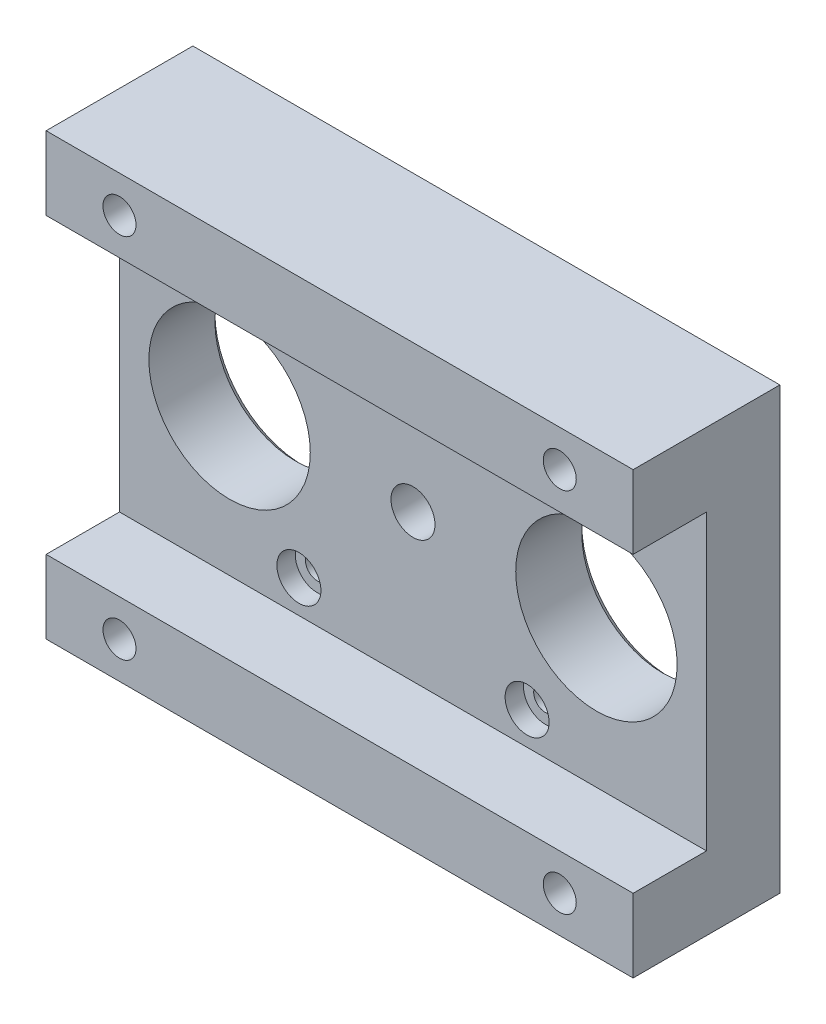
ISO-10303-21;
HEADER;
FILE_DESCRIPTION(('STEP AP214'),'2;1');
FILE_NAME('part.step','',(''),(''),'','','');
FILE_SCHEMA(('AUTOMOTIVE_DESIGN { 1 0 10303 214 1 1 1 1 }'));
ENDSEC;
DATA;
#1=APPLICATION_CONTEXT('core data for automotive mechanical design processes');
#2=APPLICATION_PROTOCOL_DEFINITION('international standard','automotive_design',2000,#1);
#3=PRODUCT_CONTEXT('',#1,'mechanical');
#4=PRODUCT('Part','Part','',(#3));
#5=PRODUCT_RELATED_PRODUCT_CATEGORY('part','',(#4));
#6=PRODUCT_DEFINITION_FORMATION('','',#4);
#7=PRODUCT_DEFINITION_CONTEXT('part definition',#1,'design');
#8=PRODUCT_DEFINITION('design','',#6,#7);
#9=PRODUCT_DEFINITION_SHAPE('','',#8);
#10=(LENGTH_UNIT() NAMED_UNIT(*) SI_UNIT(.MILLI.,.METRE.));
#11=(NAMED_UNIT(*) PLANE_ANGLE_UNIT() SI_UNIT($,.RADIAN.));
#12=(NAMED_UNIT(*) SI_UNIT($,.STERADIAN.) SOLID_ANGLE_UNIT());
#13=UNCERTAINTY_MEASURE_WITH_UNIT(LENGTH_MEASURE(1.E-05),#10,'distance_accuracy_value','');
#14=(GEOMETRIC_REPRESENTATION_CONTEXT(3) GLOBAL_UNCERTAINTY_ASSIGNED_CONTEXT((#13)) GLOBAL_UNIT_ASSIGNED_CONTEXT((#10,
#11,#12)) REPRESENTATION_CONTEXT('',''));
#15=CARTESIAN_POINT('',(0.,0.,0.));
#16=DIRECTION('',(0.,0.,1.));
#17=DIRECTION('',(1.,0.,0.));
#18=AXIS2_PLACEMENT_3D('',#15,#16,#17);
#19=CARTESIAN_POINT('',(-15.55,15.55,-2.2));
#20=DIRECTION('',(0.,0.,1.));
#21=DIRECTION('',(1.,0.,0.));
#22=AXIS2_PLACEMENT_3D('',#19,#20,#21);
#23=CYLINDRICAL_SURFACE('',#22,1.6);
#24=CARTESIAN_POINT('',(-15.55,15.55,0.));
#25=DIRECTION('',(0.,0.,1.));
#26=DIRECTION('',(1.,0.,0.));
#27=AXIS2_PLACEMENT_3D('',#24,#25,#26);
#28=CIRCLE('',#27,1.6);
#29=CARTESIAN_POINT('',(-13.95,15.55,0.));
#30=VERTEX_POINT('',#29);
#31=EDGE_CURVE('E206',#30,#30,#28,.T.);
#32=ORIENTED_EDGE('',*,*,#31,.F.);
#33=EDGE_LOOP('',(#32));
#34=FACE_BOUND('',#33,.T.);
#35=CARTESIAN_POINT('',(-15.55,15.55,7.5));
#36=DIRECTION('',(0.,0.,1.));
#37=DIRECTION('',(1.,0.,0.));
#38=AXIS2_PLACEMENT_3D('',#35,#36,#37);
#39=CIRCLE('',#38,1.6);
#40=CARTESIAN_POINT('',(-13.95,15.55,7.5));
#41=VERTEX_POINT('',#40);
#42=EDGE_CURVE('E211',#41,#41,#39,.F.);
#43=ORIENTED_EDGE('',*,*,#42,.F.);
#44=EDGE_LOOP('',(#43));
#45=FACE_BOUND('',#44,.T.);
#46=ADVANCED_FACE('F44',(#34,#45),#23,.F.);
#47=CARTESIAN_POINT('',(15.55,15.55,-2.2));
#48=DIRECTION('',(0.,0.,1.));
#49=DIRECTION('',(1.,0.,0.));
#50=AXIS2_PLACEMENT_3D('',#47,#48,#49);
#51=CYLINDRICAL_SURFACE('',#50,1.6);
#52=CARTESIAN_POINT('',(15.55,15.55,0.));
#53=DIRECTION('',(0.,0.,1.));
#54=DIRECTION('',(1.,0.,0.));
#55=AXIS2_PLACEMENT_3D('',#52,#53,#54);
#56=CIRCLE('',#55,1.6);
#57=CARTESIAN_POINT('',(17.15,15.55,0.));
#58=VERTEX_POINT('',#57);
#59=EDGE_CURVE('E210',#58,#58,#56,.T.);
#60=ORIENTED_EDGE('',*,*,#59,.F.);
#61=EDGE_LOOP('',(#60));
#62=FACE_BOUND('',#61,.T.);
#63=CARTESIAN_POINT('',(15.55,15.55,7.5));
#64=DIRECTION('',(0.,0.,1.));
#65=DIRECTION('',(1.,0.,0.));
#66=AXIS2_PLACEMENT_3D('',#63,#64,#65);
#67=CIRCLE('',#66,1.6);
#68=CARTESIAN_POINT('',(17.15,15.55,7.5));
#69=VERTEX_POINT('',#68);
#70=EDGE_CURVE('E233',#69,#69,#67,.F.);
#71=ORIENTED_EDGE('',*,*,#70,.F.);
#72=EDGE_LOOP('',(#71));
#73=FACE_BOUND('',#72,.T.);
#74=ADVANCED_FACE('F420',(#62,#73),#51,.F.);
#75=CARTESIAN_POINT('',(15.55,-15.55,-2.2));
#76=DIRECTION('',(0.,0.,1.));
#77=DIRECTION('',(1.,0.,0.));
#78=AXIS2_PLACEMENT_3D('',#75,#76,#77);
#79=CYLINDRICAL_SURFACE('',#78,1.6);
#80=CARTESIAN_POINT('',(15.55,-15.55,0.));
#81=DIRECTION('',(0.,0.,1.));
#82=DIRECTION('',(1.,0.,0.));
#83=AXIS2_PLACEMENT_3D('',#80,#81,#82);
#84=CIRCLE('',#83,1.6);
#85=CARTESIAN_POINT('',(17.15,-15.55,0.));
#86=VERTEX_POINT('',#85);
#87=EDGE_CURVE('E215',#86,#86,#84,.T.);
#88=ORIENTED_EDGE('',*,*,#87,.F.);
#89=EDGE_LOOP('',(#88));
#90=FACE_BOUND('',#89,.T.);
#91=CARTESIAN_POINT('',(15.55,-15.55,7.5));
#92=DIRECTION('',(0.,0.,1.));
#93=DIRECTION('',(1.,0.,0.));
#94=AXIS2_PLACEMENT_3D('',#91,#92,#93);
#95=CIRCLE('',#94,1.6);
#96=CARTESIAN_POINT('',(17.15,-15.55,7.5));
#97=VERTEX_POINT('',#96);
#98=EDGE_CURVE('E228',#97,#97,#95,.F.);
#99=ORIENTED_EDGE('',*,*,#98,.F.);
#100=EDGE_LOOP('',(#99));
#101=FACE_BOUND('',#100,.T.);
#102=ADVANCED_FACE('F426',(#90,#101),#79,.F.);
#103=CARTESIAN_POINT('',(-15.55,-15.55,-2.2));
#104=DIRECTION('',(0.,0.,1.));
#105=DIRECTION('',(1.,0.,0.));
#106=AXIS2_PLACEMENT_3D('',#103,#104,#105);
#107=CYLINDRICAL_SURFACE('',#106,1.6);
#108=CARTESIAN_POINT('',(-15.55,-15.55,0.));
#109=DIRECTION('',(0.,0.,1.));
#110=DIRECTION('',(1.,0.,0.));
#111=AXIS2_PLACEMENT_3D('',#108,#109,#110);
#112=CIRCLE('',#111,1.6);
#113=CARTESIAN_POINT('',(-13.95,-15.55,0.));
#114=VERTEX_POINT('',#113);
#115=EDGE_CURVE('E219',#114,#114,#112,.T.);
#116=ORIENTED_EDGE('',*,*,#115,.F.);
#117=EDGE_LOOP('',(#116));
#118=FACE_BOUND('',#117,.T.);
#119=CARTESIAN_POINT('',(-15.55,-15.55,7.5));
#120=DIRECTION('',(0.,0.,1.));
#121=DIRECTION('',(1.,0.,0.));
#122=AXIS2_PLACEMENT_3D('',#119,#120,#121);
#123=CIRCLE('',#122,1.6);
#124=CARTESIAN_POINT('',(-13.95,-15.55,7.5));
#125=VERTEX_POINT('',#124);
#126=EDGE_CURVE('E224',#125,#125,#123,.F.);
#127=ORIENTED_EDGE('',*,*,#126,.F.);
#128=EDGE_LOOP('',(#127));
#129=FACE_BOUND('',#128,.T.);
#130=ADVANCED_FACE('F385',(#118,#129),#107,.F.);
#131=CARTESIAN_POINT('',(0.,0.,10.));
#132=DIRECTION('',(0.,0.,1.));
#133=DIRECTION('',(1.,0.,0.));
#134=AXIS2_PLACEMENT_3D('',#131,#132,#133);
#135=PLANE('',#134);
#136=CARTESIAN_POINT('',(15.55,15.55,10.));
#137=DIRECTION('',(0.,0.,1.));
#138=DIRECTION('',(1.,0.,0.));
#139=AXIS2_PLACEMENT_3D('',#136,#137,#138);
#140=CIRCLE('',#139,3.);
#141=CARTESIAN_POINT('',(18.55,15.55,10.));
#142=VERTEX_POINT('',#141);
#143=EDGE_CURVE('E352',#142,#142,#140,.T.);
#144=ORIENTED_EDGE('',*,*,#143,.F.);
#145=EDGE_LOOP('',(#144));
#146=FACE_BOUND('',#145,.T.);
#147=CARTESIAN_POINT('',(-15.55,-15.55,10.));
#148=DIRECTION('',(0.,0.,1.));
#149=DIRECTION('',(1.,0.,0.));
#150=AXIS2_PLACEMENT_3D('',#147,#148,#149);
#151=CIRCLE('',#150,3.);
#152=CARTESIAN_POINT('',(-12.55,-15.55,10.));
#153=VERTEX_POINT('',#152);
#154=EDGE_CURVE('E360',#153,#153,#151,.T.);
#155=ORIENTED_EDGE('',*,*,#154,.F.);
#156=EDGE_LOOP('',(#155));
#157=FACE_BOUND('',#156,.T.);
#158=CARTESIAN_POINT('',(15.55,-15.55,10.));
#159=DIRECTION('',(0.,0.,1.));
#160=DIRECTION('',(1.,0.,0.));
#161=AXIS2_PLACEMENT_3D('',#158,#159,#160);
#162=CIRCLE('',#161,3.);
#163=CARTESIAN_POINT('',(18.55,-15.55,10.));
#164=VERTEX_POINT('',#163);
#165=EDGE_CURVE('E361',#164,#164,#162,.T.);
#166=ORIENTED_EDGE('',*,*,#165,.F.);
#167=EDGE_LOOP('',(#166));
#168=FACE_BOUND('',#167,.T.);
#169=CARTESIAN_POINT('',(-15.55,15.55,10.));
#170=DIRECTION('',(0.,0.,1.));
#171=DIRECTION('',(1.,0.,0.));
#172=AXIS2_PLACEMENT_3D('',#169,#170,#171);
#173=CIRCLE('',#172,3.);
#174=CARTESIAN_POINT('',(-12.55,15.55,10.));
#175=VERTEX_POINT('',#174);
#176=EDGE_CURVE('E348',#175,#175,#173,.T.);
#177=ORIENTED_EDGE('',*,*,#176,.F.);
#178=EDGE_LOOP('',(#177));
#179=FACE_BOUND('',#178,.T.);
#180=CARTESIAN_POINT('',(-25.,0.,10.));
#181=DIRECTION('',(0.,0.,1.));
#182=DIRECTION('',(1.,0.,0.));
#183=AXIS2_PLACEMENT_3D('',#180,#181,#182);
#184=CIRCLE('',#183,11.);
#185=CARTESIAN_POINT('',(-14.,0.,10.));
#186=VERTEX_POINT('',#185);
#187=EDGE_CURVE('E323',#186,#186,#184,.T.);
#188=ORIENTED_EDGE('',*,*,#187,.F.);
#189=EDGE_LOOP('',(#188));
#190=FACE_BOUND('',#189,.T.);
#191=CARTESIAN_POINT('',(25.,0.,10.));
#192=DIRECTION('',(0.,0.,1.));
#193=DIRECTION('',(1.,0.,0.));
#194=AXIS2_PLACEMENT_3D('',#191,#192,#193);
#195=CIRCLE('',#194,11.);
#196=CARTESIAN_POINT('',(36.,0.,10.));
#197=VERTEX_POINT('',#196);
#198=EDGE_CURVE('E223',#197,#197,#195,.T.);
#199=ORIENTED_EDGE('',*,*,#198,.F.);
#200=EDGE_LOOP('',(#199));
#201=FACE_BOUND('',#200,.T.);
#202=CARTESIAN_POINT('',(0.,0.,10.));
#203=DIRECTION('',(0.,0.,1.));
#204=DIRECTION('',(1.,0.,0.));
#205=AXIS2_PLACEMENT_3D('',#202,#203,#204);
#206=CIRCLE('',#205,3.);
#207=CARTESIAN_POINT('',(-3.,0.,10.));
#208=VERTEX_POINT('',#207);
#209=EDGE_CURVE('E200',#208,#208,#206,.T.);
#210=ORIENTED_EDGE('',*,*,#209,.F.);
#211=EDGE_LOOP('',(#210));
#212=FACE_BOUND('',#211,.T.);
#213=DIRECTION('',(0.,-1.,0.));
#214=VECTOR('',#213,1.);
#215=CARTESIAN_POINT('',(-40.,30.,10.));
#216=LINE('',#215,#214);
#217=CARTESIAN_POINT('',(-40.,20.,10.));
#218=VERTEX_POINT('',#217);
#219=CARTESIAN_POINT('',(-40.,-20.,10.));
#220=VERTEX_POINT('',#219);
#221=EDGE_CURVE('E66',#218,#220,#216,.T.);
#222=ORIENTED_EDGE('',*,*,#221,.T.);
#223=DIRECTION('',(-1.,0.,0.));
#224=VECTOR('',#223,1.);
#225=CARTESIAN_POINT('',(40.,-20.,10.));
#226=LINE('',#225,#224);
#227=CARTESIAN_POINT('',(40.,-20.,10.));
#228=VERTEX_POINT('',#227);
#229=EDGE_CURVE('E61',#228,#220,#226,.T.);
#230=ORIENTED_EDGE('',*,*,#229,.F.);
#231=DIRECTION('',(0.,1.,0.));
#232=VECTOR('',#231,1.);
#233=CARTESIAN_POINT('',(40.,30.,10.));
#234=LINE('',#233,#232);
#235=CARTESIAN_POINT('',(40.,20.,10.));
#236=VERTEX_POINT('',#235);
#237=EDGE_CURVE('E174',#228,#236,#234,.T.);
#238=ORIENTED_EDGE('',*,*,#237,.T.);
#239=DIRECTION('',(1.,0.,0.));
#240=VECTOR('',#239,1.);
#241=CARTESIAN_POINT('',(-40.,20.,10.));
#242=LINE('',#241,#240);
#243=EDGE_CURVE('E142',#218,#236,#242,.T.);
#244=ORIENTED_EDGE('',*,*,#243,.F.);
#245=EDGE_LOOP('',(#222,#230,#238,#244));
#246=FACE_BOUND('',#245,.T.);
#247=ADVANCED_FACE('F382',(#146,#157,#168,#179,#190,#201,#212,#246),#135,.T.);
#248=CARTESIAN_POINT('',(40.,30.,10.));
#249=DIRECTION('',(-1.,0.,0.));
#250=DIRECTION('',(0.,-1.,0.));
#251=AXIS2_PLACEMENT_3D('',#248,#249,#250);
#252=PLANE('',#251);
#253=DIRECTION('',(0.,1.,0.));
#254=VECTOR('',#253,1.);
#255=CARTESIAN_POINT('',(40.,30.,0.));
#256=LINE('',#255,#254);
#257=CARTESIAN_POINT('',(40.,-30.,0.));
#258=VERTEX_POINT('',#257);
#259=CARTESIAN_POINT('',(40.,30.,0.));
#260=VERTEX_POINT('',#259);
#261=EDGE_CURVE('E173',#258,#260,#256,.T.);
#262=ORIENTED_EDGE('',*,*,#261,.T.);
#263=DIRECTION('',(0.,0.,-1.));
#264=VECTOR('',#263,1.);
#265=CARTESIAN_POINT('',(40.,30.,10.));
#266=LINE('',#265,#264);
#267=CARTESIAN_POINT('',(40.,30.,20.));
#268=VERTEX_POINT('',#267);
#269=EDGE_CURVE('E195',#268,#260,#266,.T.);
#270=ORIENTED_EDGE('',*,*,#269,.F.);
#271=DIRECTION('',(0.,1.,0.));
#272=VECTOR('',#271,1.);
#273=CARTESIAN_POINT('',(40.,30.,20.));
#274=LINE('',#273,#272);
#275=CARTESIAN_POINT('',(40.,20.,20.));
#276=VERTEX_POINT('',#275);
#277=EDGE_CURVE('E154',#276,#268,#274,.T.);
#278=ORIENTED_EDGE('',*,*,#277,.F.);
#279=DIRECTION('',(0.,0.,-1.));
#280=VECTOR('',#279,1.);
#281=CARTESIAN_POINT('',(40.,20.,20.));
#282=LINE('',#281,#280);
#283=EDGE_CURVE('E162',#276,#236,#282,.T.);
#284=ORIENTED_EDGE('',*,*,#283,.T.);
#285=ORIENTED_EDGE('',*,*,#237,.F.);
#286=DIRECTION('',(0.,0.,-1.));
#287=VECTOR('',#286,1.);
#288=CARTESIAN_POINT('',(40.,-20.,20.));
#289=LINE('',#288,#287);
#290=CARTESIAN_POINT('',(40.,-20.,20.));
#291=VERTEX_POINT('',#290);
#292=EDGE_CURVE('E136',#291,#228,#289,.T.);
#293=ORIENTED_EDGE('',*,*,#292,.F.);
#294=DIRECTION('',(0.,1.,0.));
#295=VECTOR('',#294,1.);
#296=CARTESIAN_POINT('',(40.,-30.,20.));
#297=LINE('',#296,#295);
#298=CARTESIAN_POINT('',(40.,-30.,20.));
#299=VERTEX_POINT('',#298);
#300=EDGE_CURVE('E127',#299,#291,#297,.T.);
#301=ORIENTED_EDGE('',*,*,#300,.F.);
#302=DIRECTION('',(0.,0.,-1.));
#303=VECTOR('',#302,1.);
#304=CARTESIAN_POINT('',(40.,-30.,10.));
#305=LINE('',#304,#303);
#306=EDGE_CURVE('E109',#299,#258,#305,.T.);
#307=ORIENTED_EDGE('',*,*,#306,.T.);
#308=EDGE_LOOP('',(#262,#270,#278,#284,#285,#293,#301,#307));
#309=FACE_BOUND('',#308,.T.);
#310=ADVANCED_FACE('F134',(#309),#252,.F.);
#311=CARTESIAN_POINT('',(-40.,30.,10.));
#312=DIRECTION('',(0.,-1.,0.));
#313=DIRECTION('',(0.,0.,-1.));
#314=AXIS2_PLACEMENT_3D('',#311,#312,#313);
#315=PLANE('',#314);
#316=DIRECTION('',(-1.,0.,0.));
#317=VECTOR('',#316,1.);
#318=CARTESIAN_POINT('',(-40.,30.,0.));
#319=LINE('',#318,#317);
#320=CARTESIAN_POINT('',(-40.,30.,0.));
#321=VERTEX_POINT('',#320);
#322=EDGE_CURVE('E181',#260,#321,#319,.T.);
#323=ORIENTED_EDGE('',*,*,#322,.T.);
#324=DIRECTION('',(0.,0.,-1.));
#325=VECTOR('',#324,1.);
#326=CARTESIAN_POINT('',(-40.,30.,10.));
#327=LINE('',#326,#325);
#328=CARTESIAN_POINT('',(-40.,30.,20.));
#329=VERTEX_POINT('',#328);
#330=EDGE_CURVE('E191',#329,#321,#327,.T.);
#331=ORIENTED_EDGE('',*,*,#330,.F.);
#332=DIRECTION('',(-1.,0.,0.));
#333=VECTOR('',#332,1.);
#334=CARTESIAN_POINT('',(-40.,30.,20.));
#335=LINE('',#334,#333);
#336=EDGE_CURVE('E158',#268,#329,#335,.T.);
#337=ORIENTED_EDGE('',*,*,#336,.F.);
#338=ORIENTED_EDGE('',*,*,#269,.T.);
#339=EDGE_LOOP('',(#323,#331,#337,#338));
#340=FACE_BOUND('',#339,.T.);
#341=ADVANCED_FACE('F285',(#340),#315,.F.);
#342=CARTESIAN_POINT('',(-40.,30.,10.));
#343=DIRECTION('',(1.,0.,0.));
#344=DIRECTION('',(0.,1.,0.));
#345=AXIS2_PLACEMENT_3D('',#342,#343,#344);
#346=PLANE('',#345);
#347=DIRECTION('',(0.,-1.,0.));
#348=VECTOR('',#347,1.);
#349=CARTESIAN_POINT('',(-40.,30.,0.));
#350=LINE('',#349,#348);
#351=CARTESIAN_POINT('',(-40.,-30.,0.));
#352=VERTEX_POINT('',#351);
#353=EDGE_CURVE('E184',#321,#352,#350,.T.);
#354=ORIENTED_EDGE('',*,*,#353,.T.);
#355=DIRECTION('',(0.,0.,-1.));
#356=VECTOR('',#355,1.);
#357=CARTESIAN_POINT('',(-40.,-30.,10.));
#358=LINE('',#357,#356);
#359=CARTESIAN_POINT('',(-40.,-30.,20.));
#360=VERTEX_POINT('',#359);
#361=EDGE_CURVE('E121',#360,#352,#358,.T.);
#362=ORIENTED_EDGE('',*,*,#361,.F.);
#363=DIRECTION('',(0.,-1.,0.));
#364=VECTOR('',#363,1.);
#365=CARTESIAN_POINT('',(-40.,-30.,20.));
#366=LINE('',#365,#364);
#367=CARTESIAN_POINT('',(-40.,-20.,20.));
#368=VERTEX_POINT('',#367);
#369=EDGE_CURVE('E130',#368,#360,#366,.T.);
#370=ORIENTED_EDGE('',*,*,#369,.F.);
#371=DIRECTION('',(0.,0.,-1.));
#372=VECTOR('',#371,1.);
#373=CARTESIAN_POINT('',(-40.,-20.,20.));
#374=LINE('',#373,#372);
#375=EDGE_CURVE('E132',#368,#220,#374,.T.);
#376=ORIENTED_EDGE('',*,*,#375,.T.);
#377=ORIENTED_EDGE('',*,*,#221,.F.);
#378=DIRECTION('',(0.,0.,-1.));
#379=VECTOR('',#378,1.);
#380=CARTESIAN_POINT('',(-40.,20.,20.));
#381=LINE('',#380,#379);
#382=CARTESIAN_POINT('',(-40.,20.,20.));
#383=VERTEX_POINT('',#382);
#384=EDGE_CURVE('E169',#383,#218,#381,.T.);
#385=ORIENTED_EDGE('',*,*,#384,.F.);
#386=DIRECTION('',(0.,-1.,0.));
#387=VECTOR('',#386,1.);
#388=CARTESIAN_POINT('',(-40.,30.,20.));
#389=LINE('',#388,#387);
#390=EDGE_CURVE('E147',#329,#383,#389,.T.);
#391=ORIENTED_EDGE('',*,*,#390,.F.);
#392=ORIENTED_EDGE('',*,*,#330,.T.);
#393=EDGE_LOOP('',(#354,#362,#370,#376,#377,#385,#391,#392));
#394=FACE_BOUND('',#393,.T.);
#395=ADVANCED_FACE('F287',(#394),#346,.F.);
#396=CARTESIAN_POINT('',(-40.,-30.,10.));
#397=DIRECTION('',(0.,1.,0.));
#398=DIRECTION('',(0.,0.,1.));
#399=AXIS2_PLACEMENT_3D('',#396,#397,#398);
#400=PLANE('',#399);
#401=DIRECTION('',(1.,0.,0.));
#402=VECTOR('',#401,1.);
#403=CARTESIAN_POINT('',(-40.,-30.,0.));
#404=LINE('',#403,#402);
#405=EDGE_CURVE('E115',#352,#258,#404,.T.);
#406=ORIENTED_EDGE('',*,*,#405,.T.);
#407=ORIENTED_EDGE('',*,*,#306,.F.);
#408=DIRECTION('',(1.,0.,0.));
#409=VECTOR('',#408,1.);
#410=CARTESIAN_POINT('',(40.,-30.,20.));
#411=LINE('',#410,#409);
#412=EDGE_CURVE('E113',#360,#299,#411,.T.);
#413=ORIENTED_EDGE('',*,*,#412,.F.);
#414=ORIENTED_EDGE('',*,*,#361,.T.);
#415=EDGE_LOOP('',(#406,#407,#413,#414));
#416=FACE_BOUND('',#415,.T.);
#417=ADVANCED_FACE('F111',(#416),#400,.F.);
#418=CARTESIAN_POINT('',(0.,0.,0.));
#419=DIRECTION('',(0.,0.,1.));
#420=DIRECTION('',(1.,0.,0.));
#421=AXIS2_PLACEMENT_3D('',#418,#419,#420);
#422=PLANE('',#421);
#423=CARTESIAN_POINT('',(25.,0.,0.));
#424=DIRECTION('',(0.,0.,1.));
#425=DIRECTION('',(1.,0.,0.));
#426=AXIS2_PLACEMENT_3D('',#423,#424,#425);
#427=CIRCLE('',#426,12.);
#428=CARTESIAN_POINT('',(37.,0.,0.));
#429=VERTEX_POINT('',#428);
#430=EDGE_CURVE('E243',#429,#429,#427,.T.);
#431=ORIENTED_EDGE('',*,*,#430,.T.);
#432=EDGE_LOOP('',(#431));
#433=FACE_BOUND('',#432,.T.);
#434=CARTESIAN_POINT('',(-25.,0.,0.));
#435=DIRECTION('',(0.,0.,1.));
#436=DIRECTION('',(1.,0.,0.));
#437=AXIS2_PLACEMENT_3D('',#434,#435,#436);
#438=CIRCLE('',#437,12.);
#439=CARTESIAN_POINT('',(-13.,0.,0.));
#440=VERTEX_POINT('',#439);
#441=EDGE_CURVE('E199',#440,#440,#438,.T.);
#442=ORIENTED_EDGE('',*,*,#441,.T.);
#443=EDGE_LOOP('',(#442));
#444=FACE_BOUND('',#443,.T.);
#445=ORIENTED_EDGE('',*,*,#115,.T.);
#446=EDGE_LOOP('',(#445));
#447=FACE_BOUND('',#446,.T.);
#448=ORIENTED_EDGE('',*,*,#87,.T.);
#449=EDGE_LOOP('',(#448));
#450=FACE_BOUND('',#449,.T.);
#451=ORIENTED_EDGE('',*,*,#59,.T.);
#452=EDGE_LOOP('',(#451));
#453=FACE_BOUND('',#452,.T.);
#454=ORIENTED_EDGE('',*,*,#31,.T.);
#455=EDGE_LOOP('',(#454));
#456=FACE_BOUND('',#455,.T.);
#457=CARTESIAN_POINT('',(0.,0.,0.));
#458=DIRECTION('',(0.,0.,-1.));
#459=DIRECTION('',(-1.,0.,0.));
#460=AXIS2_PLACEMENT_3D('',#457,#458,#459);
#461=CIRCLE('',#460,11.35);
#462=CARTESIAN_POINT('',(-11.35,0.,0.));
#463=VERTEX_POINT('',#462);
#464=EDGE_CURVE('E204',#463,#463,#461,.T.);
#465=ORIENTED_EDGE('',*,*,#464,.F.);
#466=EDGE_LOOP('',(#465));
#467=FACE_BOUND('',#466,.T.);
#468=ORIENTED_EDGE('',*,*,#261,.F.);
#469=ORIENTED_EDGE('',*,*,#405,.F.);
#470=ORIENTED_EDGE('',*,*,#353,.F.);
#471=ORIENTED_EDGE('',*,*,#322,.F.);
#472=EDGE_LOOP('',(#468,#469,#470,#471));
#473=FACE_BOUND('',#472,.T.);
#474=ADVANCED_FACE('F259',(#433,#444,#447,#450,#453,#456,#467,#473),#422,.F.);
#475=CARTESIAN_POINT('',(-40.,20.,20.));
#476=DIRECTION('',(0.,1.,0.));
#477=DIRECTION('',(-1.,0.,0.));
#478=AXIS2_PLACEMENT_3D('',#475,#476,#477);
#479=PLANE('',#478);
#480=ORIENTED_EDGE('',*,*,#243,.T.);
#481=ORIENTED_EDGE('',*,*,#283,.F.);
#482=DIRECTION('',(1.,0.,0.));
#483=VECTOR('',#482,1.);
#484=CARTESIAN_POINT('',(-40.,20.,20.));
#485=LINE('',#484,#483);
#486=EDGE_CURVE('E151',#383,#276,#485,.T.);
#487=ORIENTED_EDGE('',*,*,#486,.F.);
#488=ORIENTED_EDGE('',*,*,#384,.T.);
#489=EDGE_LOOP('',(#480,#481,#487,#488));
#490=FACE_BOUND('',#489,.T.);
#491=ADVANCED_FACE('F262',(#490),#479,.F.);
#492=CARTESIAN_POINT('',(0.,0.,20.));
#493=DIRECTION('',(0.,0.,1.));
#494=DIRECTION('',(1.,0.,0.));
#495=AXIS2_PLACEMENT_3D('',#492,#493,#494);
#496=PLANE('',#495);
#497=CARTESIAN_POINT('',(-30.,25.,20.));
#498=DIRECTION('',(0.,0.,1.));
#499=DIRECTION('',(1.,0.,0.));
#500=AXIS2_PLACEMENT_3D('',#497,#498,#499);
#501=CIRCLE('',#500,2.25);
#502=CARTESIAN_POINT('',(-27.75,25.,20.));
#503=VERTEX_POINT('',#502);
#504=EDGE_CURVE('E314',#503,#503,#501,.T.);
#505=ORIENTED_EDGE('',*,*,#504,.F.);
#506=EDGE_LOOP('',(#505));
#507=FACE_BOUND('',#506,.T.);
#508=CARTESIAN_POINT('',(30.,25.,20.));
#509=DIRECTION('',(0.,0.,1.));
#510=DIRECTION('',(1.,0.,0.));
#511=AXIS2_PLACEMENT_3D('',#508,#509,#510);
#512=CIRCLE('',#511,2.25);
#513=CARTESIAN_POINT('',(32.25,25.,20.));
#514=VERTEX_POINT('',#513);
#515=EDGE_CURVE('E310',#514,#514,#512,.T.);
#516=ORIENTED_EDGE('',*,*,#515,.F.);
#517=EDGE_LOOP('',(#516));
#518=FACE_BOUND('',#517,.T.);
#519=ORIENTED_EDGE('',*,*,#390,.T.);
#520=ORIENTED_EDGE('',*,*,#486,.T.);
#521=ORIENTED_EDGE('',*,*,#277,.T.);
#522=ORIENTED_EDGE('',*,*,#336,.T.);
#523=EDGE_LOOP('',(#519,#520,#521,#522));
#524=FACE_BOUND('',#523,.T.);
#525=ADVANCED_FACE('F282',(#507,#518,#524),#496,.T.);
#526=CARTESIAN_POINT('',(40.,-20.,20.));
#527=DIRECTION('',(0.,-1.,0.));
#528=DIRECTION('',(1.,0.,0.));
#529=AXIS2_PLACEMENT_3D('',#526,#527,#528);
#530=PLANE('',#529);
#531=ORIENTED_EDGE('',*,*,#229,.T.);
#532=ORIENTED_EDGE('',*,*,#375,.F.);
#533=DIRECTION('',(-1.,0.,0.));
#534=VECTOR('',#533,1.);
#535=CARTESIAN_POINT('',(40.,-20.,20.));
#536=LINE('',#535,#534);
#537=EDGE_CURVE('E138',#291,#368,#536,.T.);
#538=ORIENTED_EDGE('',*,*,#537,.F.);
#539=ORIENTED_EDGE('',*,*,#292,.T.);
#540=EDGE_LOOP('',(#531,#532,#538,#539));
#541=FACE_BOUND('',#540,.T.);
#542=ADVANCED_FACE('F292',(#541),#530,.F.);
#543=CARTESIAN_POINT('',(0.,0.,20.));
#544=DIRECTION('',(0.,0.,1.));
#545=DIRECTION('',(1.,0.,0.));
#546=AXIS2_PLACEMENT_3D('',#543,#544,#545);
#547=PLANE('',#546);
#548=CARTESIAN_POINT('',(30.,-25.,20.));
#549=DIRECTION('',(0.,0.,1.));
#550=DIRECTION('',(1.,0.,0.));
#551=AXIS2_PLACEMENT_3D('',#548,#549,#550);
#552=CIRCLE('',#551,2.25);
#553=CARTESIAN_POINT('',(32.25,-25.,20.));
#554=VERTEX_POINT('',#553);
#555=EDGE_CURVE('E322',#554,#554,#552,.T.);
#556=ORIENTED_EDGE('',*,*,#555,.F.);
#557=EDGE_LOOP('',(#556));
#558=FACE_BOUND('',#557,.T.);
#559=CARTESIAN_POINT('',(-30.,-25.,20.));
#560=DIRECTION('',(0.,0.,1.));
#561=DIRECTION('',(1.,0.,0.));
#562=AXIS2_PLACEMENT_3D('',#559,#560,#561);
#563=CIRCLE('',#562,2.25);
#564=CARTESIAN_POINT('',(-27.75,-25.,20.));
#565=VERTEX_POINT('',#564);
#566=EDGE_CURVE('E331',#565,#565,#563,.T.);
#567=ORIENTED_EDGE('',*,*,#566,.F.);
#568=EDGE_LOOP('',(#567));
#569=FACE_BOUND('',#568,.T.);
#570=ORIENTED_EDGE('',*,*,#300,.T.);
#571=ORIENTED_EDGE('',*,*,#537,.T.);
#572=ORIENTED_EDGE('',*,*,#369,.T.);
#573=ORIENTED_EDGE('',*,*,#412,.T.);
#574=EDGE_LOOP('',(#570,#571,#572,#573));
#575=FACE_BOUND('',#574,.T.);
#576=ADVANCED_FACE('F126',(#558,#569,#575),#547,.T.);
#577=CARTESIAN_POINT('',(0.,0.,2.2));
#578=DIRECTION('',(0.,0.,-1.));
#579=DIRECTION('',(-1.,0.,0.));
#580=AXIS2_PLACEMENT_3D('',#577,#578,#579);
#581=CYLINDRICAL_SURFACE('',#580,11.35);
#582=CARTESIAN_POINT('',(0.,0.,2.2));
#583=DIRECTION('',(0.,0.,-1.));
#584=DIRECTION('',(-1.,0.,0.));
#585=AXIS2_PLACEMENT_3D('',#582,#583,#584);
#586=CIRCLE('',#585,11.35);
#587=CARTESIAN_POINT('',(-11.35,0.,2.2));
#588=VERTEX_POINT('',#587);
#589=EDGE_CURVE('E295',#588,#588,#586,.T.);
#590=ORIENTED_EDGE('',*,*,#589,.F.);
#591=EDGE_LOOP('',(#590));
#592=FACE_BOUND('',#591,.T.);
#593=ORIENTED_EDGE('',*,*,#464,.T.);
#594=EDGE_LOOP('',(#593));
#595=FACE_BOUND('',#594,.T.);
#596=ADVANCED_FACE('F406',(#592,#595),#581,.F.);
#597=CARTESIAN_POINT('',(0.,0.,2.2));
#598=DIRECTION('',(0.,0.,-1.));
#599=DIRECTION('',(-1.,0.,0.));
#600=AXIS2_PLACEMENT_3D('',#597,#598,#599);
#601=PLANE('',#600);
#602=CARTESIAN_POINT('',(0.,0.,2.2));
#603=DIRECTION('',(0.,0.,-1.));
#604=DIRECTION('',(-1.,0.,0.));
#605=AXIS2_PLACEMENT_3D('',#602,#603,#604);
#606=CIRCLE('',#605,3.);
#607=CARTESIAN_POINT('',(-3.,0.,2.2));
#608=VERTEX_POINT('',#607);
#609=EDGE_CURVE('E205',#608,#608,#606,.T.);
#610=ORIENTED_EDGE('',*,*,#609,.F.);
#611=EDGE_LOOP('',(#610));
#612=FACE_BOUND('',#611,.T.);
#613=ORIENTED_EDGE('',*,*,#589,.T.);
#614=EDGE_LOOP('',(#613));
#615=FACE_BOUND('',#614,.T.);
#616=ADVANCED_FACE('F400',(#612,#615),#601,.T.);
#617=CARTESIAN_POINT('',(0.,0.,14.4));
#618=DIRECTION('',(0.,0.,-1.));
#619=DIRECTION('',(-1.,0.,0.));
#620=AXIS2_PLACEMENT_3D('',#617,#618,#619);
#621=CYLINDRICAL_SURFACE('',#620,3.);
#622=CARTESIAN_POINT('',(-3.,0.,10.));
#623=CARTESIAN_POINT('',(-3.,0.,9.91875));
#624=CARTESIAN_POINT('',(-3.,0.,9.8375));
#625=CARTESIAN_POINT('',(-3.,0.,9.675));
#626=CARTESIAN_POINT('',(-3.,0.,9.59375));
#627=CARTESIAN_POINT('',(-3.,0.,9.43125));
#628=CARTESIAN_POINT('',(-3.,0.,9.35));
#629=CARTESIAN_POINT('',(-3.,0.,9.1875));
#630=CARTESIAN_POINT('',(-3.,0.,9.10625));
#631=CARTESIAN_POINT('',(-3.,0.,8.94375));
#632=CARTESIAN_POINT('',(-3.,0.,8.8625));
#633=CARTESIAN_POINT('',(-3.,0.,8.7));
#634=CARTESIAN_POINT('',(-3.,0.,8.61875));
#635=CARTESIAN_POINT('',(-3.,0.,8.45625));
#636=CARTESIAN_POINT('',(-3.,0.,8.375));
#637=CARTESIAN_POINT('',(-3.,0.,8.2125));
#638=CARTESIAN_POINT('',(-3.,0.,8.13125));
#639=CARTESIAN_POINT('',(-3.,0.,7.96875));
#640=CARTESIAN_POINT('',(-3.,0.,7.8875));
#641=CARTESIAN_POINT('',(-3.,0.,7.725));
#642=CARTESIAN_POINT('',(-3.,0.,7.64375));
#643=CARTESIAN_POINT('',(-3.,0.,7.48125));
#644=CARTESIAN_POINT('',(-3.,0.,7.4));
#645=CARTESIAN_POINT('',(-3.,0.,7.2375));
#646=CARTESIAN_POINT('',(-3.,0.,7.15625));
#647=CARTESIAN_POINT('',(-3.,0.,6.99375));
#648=CARTESIAN_POINT('',(-3.,0.,6.9125));
#649=CARTESIAN_POINT('',(-3.,0.,6.75));
#650=CARTESIAN_POINT('',(-3.,0.,6.66875));
#651=CARTESIAN_POINT('',(-3.,0.,6.50625));
#652=CARTESIAN_POINT('',(-3.,0.,6.425));
#653=CARTESIAN_POINT('',(-3.,0.,6.2625));
#654=CARTESIAN_POINT('',(-3.,0.,6.18125));
#655=CARTESIAN_POINT('',(-3.,0.,6.01875));
#656=CARTESIAN_POINT('',(-3.,0.,5.9375));
#657=CARTESIAN_POINT('',(-3.,0.,5.775));
#658=CARTESIAN_POINT('',(-3.,0.,5.69375));
#659=CARTESIAN_POINT('',(-3.,0.,5.53125));
#660=CARTESIAN_POINT('',(-3.,0.,5.45));
#661=CARTESIAN_POINT('',(-3.,0.,5.2875));
#662=CARTESIAN_POINT('',(-3.,0.,5.20625));
#663=CARTESIAN_POINT('',(-3.,0.,5.04375));
#664=CARTESIAN_POINT('',(-3.,0.,4.9625));
#665=CARTESIAN_POINT('',(-3.,0.,4.8));
#666=CARTESIAN_POINT('',(-3.,0.,4.71875));
#667=CARTESIAN_POINT('',(-3.,0.,4.55625));
#668=CARTESIAN_POINT('',(-3.,0.,4.475));
#669=CARTESIAN_POINT('',(-3.,0.,4.3125));
#670=CARTESIAN_POINT('',(-3.,0.,4.23125));
#671=CARTESIAN_POINT('',(-3.,0.,4.06875));
#672=CARTESIAN_POINT('',(-3.,0.,3.9875));
#673=CARTESIAN_POINT('',(-3.,0.,3.825));
#674=CARTESIAN_POINT('',(-3.,0.,3.74375));
#675=CARTESIAN_POINT('',(-3.,0.,3.58125));
#676=CARTESIAN_POINT('',(-3.,0.,3.5));
#677=CARTESIAN_POINT('',(-3.,0.,3.3375));
#678=CARTESIAN_POINT('',(-3.,0.,3.25625));
#679=CARTESIAN_POINT('',(-3.,0.,3.09375));
#680=CARTESIAN_POINT('',(-3.,0.,3.0125));
#681=CARTESIAN_POINT('',(-3.,0.,2.85));
#682=CARTESIAN_POINT('',(-3.,0.,2.76875));
#683=CARTESIAN_POINT('',(-3.,0.,2.60625));
#684=CARTESIAN_POINT('',(-3.,0.,2.525));
#685=CARTESIAN_POINT('',(-3.,0.,2.3625));
#686=CARTESIAN_POINT('',(-3.,0.,2.28125));
#687=CARTESIAN_POINT('',(-3.,0.,2.2));
#688=B_SPLINE_CURVE_WITH_KNOTS('',3,(#622,#623,#624,#625,#626,#627,#628,#629,#630,#631,#632,
#633,#634,#635,#636,#637,#638,#639,#640,#641,#642,#643,#644,#645,#646,#647,#648,#649,#650,#651,
#652,#653,#654,#655,#656,#657,#658,#659,#660,#661,#662,#663,#664,#665,#666,#667,#668,#669,#670,
#671,#672,#673,#674,#675,#676,#677,#678,#679,#680,#681,#682,#683,#684,#685,#686,#687),
.UNSPECIFIED.,.F.,.F.,(4,2,2,2,2,2,2,2,2,2,2,2,2,2,2,2,2,2,2,2,2,2,2,2,2,2,2,2,2,2,2,2,4),(0.,
0.243749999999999,0.487499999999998,0.731249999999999,0.975,1.21875,1.4625,1.70625,1.95,2.19375,
2.4375,2.68125,2.925,3.16875,3.4125,3.65625,3.9,4.14375,4.3875,4.63125,4.875,5.11875,5.3625,
5.60625,5.85,6.09375,6.3375,6.58125,6.825,7.06875,7.3125,7.55625,7.8),.UNSPECIFIED.);
#689=EDGE_CURVE('BSEAM396',#208,#608,#688,.T.);
#690=ORIENTED_EDGE('',*,*,#209,.T.);
#691=ORIENTED_EDGE('',*,*,#609,.T.);
#692=ORIENTED_EDGE('',*,*,#689,.T.);
#693=ORIENTED_EDGE('',*,*,#689,.F.);
#694=EDGE_LOOP('',(#690,#692,#691,#693));
#695=FACE_BOUND('',#694,.T.);
#696=ADVANCED_FACE('F396',(#695),#621,.F.);
#697=CARTESIAN_POINT('',(-30.,-25.,7.8));
#698=DIRECTION('',(0.,0.,1.));
#699=DIRECTION('',(1.,0.,0.));
#700=AXIS2_PLACEMENT_3D('',#697,#698,#699);
#701=CYLINDRICAL_SURFACE('',#700,2.25);
#702=CARTESIAN_POINT('',(-30.,-25.,7.8));
#703=DIRECTION('',(0.,0.,1.));
#704=DIRECTION('',(1.,0.,0.));
#705=AXIS2_PLACEMENT_3D('',#702,#703,#704);
#706=CIRCLE('',#705,2.25);
#707=CARTESIAN_POINT('',(-27.75,-25.,7.8));
#708=VERTEX_POINT('',#707);
#709=EDGE_CURVE('E327',#708,#708,#706,.T.);
#710=ORIENTED_EDGE('',*,*,#709,.F.);
#711=EDGE_LOOP('',(#710));
#712=FACE_BOUND('',#711,.T.);
#713=ORIENTED_EDGE('',*,*,#566,.T.);
#714=EDGE_LOOP('',(#713));
#715=FACE_BOUND('',#714,.T.);
#716=ADVANCED_FACE('F399',(#712,#715),#701,.F.);
#717=CARTESIAN_POINT('',(-30.,-25.,7.8));
#718=DIRECTION('',(0.,0.,1.));
#719=DIRECTION('',(1.,0.,0.));
#720=AXIS2_PLACEMENT_3D('',#717,#718,#719);
#721=PLANE('',#720);
#722=ORIENTED_EDGE('',*,*,#709,.T.);
#723=EDGE_LOOP('',(#722));
#724=FACE_BOUND('',#723,.T.);
#725=ADVANCED_FACE('F451',(#724),#721,.T.);
#726=CARTESIAN_POINT('',(30.,-25.,7.8));
#727=DIRECTION('',(0.,0.,1.));
#728=DIRECTION('',(1.,0.,0.));
#729=AXIS2_PLACEMENT_3D('',#726,#727,#728);
#730=CYLINDRICAL_SURFACE('',#729,2.25);
#731=CARTESIAN_POINT('',(30.,-25.,7.8));
#732=DIRECTION('',(0.,0.,1.));
#733=DIRECTION('',(1.,0.,0.));
#734=AXIS2_PLACEMENT_3D('',#731,#732,#733);
#735=CIRCLE('',#734,2.25);
#736=CARTESIAN_POINT('',(32.25,-25.,7.8));
#737=VERTEX_POINT('',#736);
#738=EDGE_CURVE('E318',#737,#737,#735,.T.);
#739=ORIENTED_EDGE('',*,*,#738,.F.);
#740=EDGE_LOOP('',(#739));
#741=FACE_BOUND('',#740,.T.);
#742=ORIENTED_EDGE('',*,*,#555,.T.);
#743=EDGE_LOOP('',(#742));
#744=FACE_BOUND('',#743,.T.);
#745=ADVANCED_FACE('F455',(#741,#744),#730,.F.);
#746=CARTESIAN_POINT('',(30.,-25.,7.8));
#747=DIRECTION('',(0.,0.,1.));
#748=DIRECTION('',(1.,0.,0.));
#749=AXIS2_PLACEMENT_3D('',#746,#747,#748);
#750=PLANE('',#749);
#751=ORIENTED_EDGE('',*,*,#738,.T.);
#752=EDGE_LOOP('',(#751));
#753=FACE_BOUND('',#752,.T.);
#754=ADVANCED_FACE('F459',(#753),#750,.T.);
#755=CARTESIAN_POINT('',(30.,25.,7.8));
#756=DIRECTION('',(0.,0.,1.));
#757=DIRECTION('',(1.,0.,0.));
#758=AXIS2_PLACEMENT_3D('',#755,#756,#757);
#759=CYLINDRICAL_SURFACE('',#758,2.25);
#760=CARTESIAN_POINT('',(30.,25.,7.8));
#761=DIRECTION('',(0.,0.,1.));
#762=DIRECTION('',(1.,0.,0.));
#763=AXIS2_PLACEMENT_3D('',#760,#761,#762);
#764=CIRCLE('',#763,2.25);
#765=CARTESIAN_POINT('',(32.25,25.,7.8));
#766=VERTEX_POINT('',#765);
#767=EDGE_CURVE('E309',#766,#766,#764,.T.);
#768=ORIENTED_EDGE('',*,*,#767,.F.);
#769=EDGE_LOOP('',(#768));
#770=FACE_BOUND('',#769,.T.);
#771=ORIENTED_EDGE('',*,*,#515,.T.);
#772=EDGE_LOOP('',(#771));
#773=FACE_BOUND('',#772,.T.);
#774=ADVANCED_FACE('F463',(#770,#773),#759,.F.);
#775=CARTESIAN_POINT('',(30.,25.,7.8));
#776=DIRECTION('',(0.,0.,1.));
#777=DIRECTION('',(1.,0.,0.));
#778=AXIS2_PLACEMENT_3D('',#775,#776,#777);
#779=PLANE('',#778);
#780=ORIENTED_EDGE('',*,*,#767,.T.);
#781=EDGE_LOOP('',(#780));
#782=FACE_BOUND('',#781,.T.);
#783=ADVANCED_FACE('F444',(#782),#779,.T.);
#784=CARTESIAN_POINT('',(-30.,25.,7.8));
#785=DIRECTION('',(0.,0.,1.));
#786=DIRECTION('',(1.,0.,0.));
#787=AXIS2_PLACEMENT_3D('',#784,#785,#786);
#788=CYLINDRICAL_SURFACE('',#787,2.25);
#789=CARTESIAN_POINT('',(-30.,25.,7.8));
#790=DIRECTION('',(0.,0.,1.));
#791=DIRECTION('',(1.,0.,0.));
#792=AXIS2_PLACEMENT_3D('',#789,#790,#791);
#793=CIRCLE('',#792,2.25);
#794=CARTESIAN_POINT('',(-27.75,25.,7.8));
#795=VERTEX_POINT('',#794);
#796=EDGE_CURVE('E335',#795,#795,#793,.T.);
#797=ORIENTED_EDGE('',*,*,#796,.F.);
#798=EDGE_LOOP('',(#797));
#799=FACE_BOUND('',#798,.T.);
#800=ORIENTED_EDGE('',*,*,#504,.T.);
#801=EDGE_LOOP('',(#800));
#802=FACE_BOUND('',#801,.T.);
#803=ADVANCED_FACE('F441',(#799,#802),#788,.F.);
#804=CARTESIAN_POINT('',(-30.,25.,7.8));
#805=DIRECTION('',(0.,0.,1.));
#806=DIRECTION('',(1.,0.,0.));
#807=AXIS2_PLACEMENT_3D('',#804,#805,#806);
#808=PLANE('',#807);
#809=ORIENTED_EDGE('',*,*,#796,.T.);
#810=EDGE_LOOP('',(#809));
#811=FACE_BOUND('',#810,.T.);
#812=ADVANCED_FACE('F440',(#811),#808,.T.);
#813=CARTESIAN_POINT('',(25.,0.,-2.2));
#814=DIRECTION('',(0.,0.,1.));
#815=DIRECTION('',(1.,0.,0.));
#816=AXIS2_PLACEMENT_3D('',#813,#814,#815);
#817=CYLINDRICAL_SURFACE('',#816,11.);
#818=CARTESIAN_POINT('',(25.,0.,0.999999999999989));
#819=DIRECTION('',(0.,0.,1.));
#820=DIRECTION('',(1.,0.,0.));
#821=AXIS2_PLACEMENT_3D('',#818,#819,#820);
#822=CIRCLE('',#821,11.);
#823=CARTESIAN_POINT('',(36.,0.,0.999999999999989));
#824=VERTEX_POINT('',#823);
#825=EDGE_CURVE('E54',#824,#824,#822,.F.);
#826=ORIENTED_EDGE('',*,*,#825,.T.);
#827=EDGE_LOOP('',(#826));
#828=FACE_BOUND('',#827,.T.);
#829=ORIENTED_EDGE('',*,*,#198,.T.);
#830=EDGE_LOOP('',(#829));
#831=FACE_BOUND('',#830,.T.);
#832=ADVANCED_FACE('F250',(#828,#831),#817,.F.);
#833=CARTESIAN_POINT('',(-25.,0.,-2.2));
#834=DIRECTION('',(0.,0.,1.));
#835=DIRECTION('',(1.,0.,0.));
#836=AXIS2_PLACEMENT_3D('',#833,#834,#835);
#837=CYLINDRICAL_SURFACE('',#836,11.);
#838=CARTESIAN_POINT('',(-25.,0.,0.999999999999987));
#839=DIRECTION('',(0.,0.,1.));
#840=DIRECTION('',(1.,0.,0.));
#841=AXIS2_PLACEMENT_3D('',#838,#839,#840);
#842=CIRCLE('',#841,11.);
#843=CARTESIAN_POINT('',(-14.,0.,0.999999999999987));
#844=VERTEX_POINT('',#843);
#845=EDGE_CURVE('E11',#844,#844,#842,.F.);
#846=ORIENTED_EDGE('',*,*,#845,.T.);
#847=EDGE_LOOP('',(#846));
#848=FACE_BOUND('',#847,.T.);
#849=ORIENTED_EDGE('',*,*,#187,.T.);
#850=EDGE_LOOP('',(#849));
#851=FACE_BOUND('',#850,.T.);
#852=ADVANCED_FACE('F433',(#848,#851),#837,.F.);
#853=CARTESIAN_POINT('',(-15.55,-15.55,7.5));
#854=DIRECTION('',(0.,0.,1.));
#855=DIRECTION('',(1.,0.,0.));
#856=AXIS2_PLACEMENT_3D('',#853,#854,#855);
#857=PLANE('',#856);
#858=CARTESIAN_POINT('',(-15.55,-15.55,7.5));
#859=DIRECTION('',(0.,0.,1.));
#860=DIRECTION('',(1.,0.,0.));
#861=AXIS2_PLACEMENT_3D('',#858,#859,#860);
#862=CIRCLE('',#861,3.);
#863=CARTESIAN_POINT('',(-12.55,-15.55,7.5));
#864=VERTEX_POINT('',#863);
#865=EDGE_CURVE('E356',#864,#864,#862,.T.);
#866=ORIENTED_EDGE('',*,*,#865,.T.);
#867=EDGE_LOOP('',(#866));
#868=FACE_BOUND('',#867,.T.);
#869=ORIENTED_EDGE('',*,*,#126,.T.);
#870=EDGE_LOOP('',(#869));
#871=FACE_BOUND('',#870,.T.);
#872=ADVANCED_FACE('F436',(#868,#871),#857,.T.);
#873=CARTESIAN_POINT('',(-15.55,-15.55,7.5));
#874=DIRECTION('',(0.,0.,1.));
#875=DIRECTION('',(1.,0.,0.));
#876=AXIS2_PLACEMENT_3D('',#873,#874,#875);
#877=CYLINDRICAL_SURFACE('',#876,3.);
#878=ORIENTED_EDGE('',*,*,#865,.F.);
#879=EDGE_LOOP('',(#878));
#880=FACE_BOUND('',#879,.T.);
#881=ORIENTED_EDGE('',*,*,#154,.T.);
#882=EDGE_LOOP('',(#881));
#883=FACE_BOUND('',#882,.T.);
#884=ADVANCED_FACE('F660',(#880,#883),#877,.F.);
#885=CARTESIAN_POINT('',(15.55,-15.55,7.5));
#886=DIRECTION('',(0.,0.,1.));
#887=DIRECTION('',(1.,0.,0.));
#888=AXIS2_PLACEMENT_3D('',#885,#886,#887);
#889=PLANE('',#888);
#890=CARTESIAN_POINT('',(15.55,-15.55,7.5));
#891=DIRECTION('',(0.,0.,1.));
#892=DIRECTION('',(1.,0.,0.));
#893=AXIS2_PLACEMENT_3D('',#890,#891,#892);
#894=CIRCLE('',#893,3.);
#895=CARTESIAN_POINT('',(18.55,-15.55,7.5));
#896=VERTEX_POINT('',#895);
#897=EDGE_CURVE('E372',#896,#896,#894,.T.);
#898=ORIENTED_EDGE('',*,*,#897,.T.);
#899=EDGE_LOOP('',(#898));
#900=FACE_BOUND('',#899,.T.);
#901=ORIENTED_EDGE('',*,*,#98,.T.);
#902=EDGE_LOOP('',(#901));
#903=FACE_BOUND('',#902,.T.);
#904=ADVANCED_FACE('F670',(#900,#903),#889,.T.);
#905=CARTESIAN_POINT('',(15.55,-15.55,7.5));
#906=DIRECTION('',(0.,0.,1.));
#907=DIRECTION('',(1.,0.,0.));
#908=AXIS2_PLACEMENT_3D('',#905,#906,#907);
#909=CYLINDRICAL_SURFACE('',#908,3.);
#910=ORIENTED_EDGE('',*,*,#897,.F.);
#911=EDGE_LOOP('',(#910));
#912=FACE_BOUND('',#911,.T.);
#913=ORIENTED_EDGE('',*,*,#165,.T.);
#914=EDGE_LOOP('',(#913));
#915=FACE_BOUND('',#914,.T.);
#916=ADVANCED_FACE('F380',(#912,#915),#909,.F.);
#917=CARTESIAN_POINT('',(15.55,15.55,7.5));
#918=DIRECTION('',(0.,0.,1.));
#919=DIRECTION('',(1.,0.,0.));
#920=AXIS2_PLACEMENT_3D('',#917,#918,#919);
#921=PLANE('',#920);
#922=CARTESIAN_POINT('',(15.55,15.55,7.5));
#923=DIRECTION('',(0.,0.,1.));
#924=DIRECTION('',(1.,0.,0.));
#925=AXIS2_PLACEMENT_3D('',#922,#923,#924);
#926=CIRCLE('',#925,3.);
#927=CARTESIAN_POINT('',(18.55,15.55,7.5));
#928=VERTEX_POINT('',#927);
#929=EDGE_CURVE('E365',#928,#928,#926,.T.);
#930=ORIENTED_EDGE('',*,*,#929,.T.);
#931=EDGE_LOOP('',(#930));
#932=FACE_BOUND('',#931,.T.);
#933=ORIENTED_EDGE('',*,*,#70,.T.);
#934=EDGE_LOOP('',(#933));
#935=FACE_BOUND('',#934,.T.);
#936=ADVANCED_FACE('F691',(#932,#935),#921,.T.);
#937=CARTESIAN_POINT('',(15.55,15.55,7.5));
#938=DIRECTION('',(0.,0.,1.));
#939=DIRECTION('',(1.,0.,0.));
#940=AXIS2_PLACEMENT_3D('',#937,#938,#939);
#941=CYLINDRICAL_SURFACE('',#940,3.);
#942=ORIENTED_EDGE('',*,*,#929,.F.);
#943=EDGE_LOOP('',(#942));
#944=FACE_BOUND('',#943,.T.);
#945=ORIENTED_EDGE('',*,*,#143,.T.);
#946=EDGE_LOOP('',(#945));
#947=FACE_BOUND('',#946,.T.);
#948=ADVANCED_FACE('F702',(#944,#947),#941,.F.);
#949=CARTESIAN_POINT('',(-15.55,15.55,7.5));
#950=DIRECTION('',(0.,0.,1.));
#951=DIRECTION('',(1.,0.,0.));
#952=AXIS2_PLACEMENT_3D('',#949,#950,#951);
#953=PLANE('',#952);
#954=CARTESIAN_POINT('',(-15.55,15.55,7.5));
#955=DIRECTION('',(0.,0.,1.));
#956=DIRECTION('',(1.,0.,0.));
#957=AXIS2_PLACEMENT_3D('',#954,#955,#956);
#958=CIRCLE('',#957,3.);
#959=CARTESIAN_POINT('',(-12.55,15.55,7.5));
#960=VERTEX_POINT('',#959);
#961=EDGE_CURVE('E229',#960,#960,#958,.T.);
#962=ORIENTED_EDGE('',*,*,#961,.T.);
#963=EDGE_LOOP('',(#962));
#964=FACE_BOUND('',#963,.T.);
#965=ORIENTED_EDGE('',*,*,#42,.T.);
#966=EDGE_LOOP('',(#965));
#967=FACE_BOUND('',#966,.T.);
#968=ADVANCED_FACE('F713',(#964,#967),#953,.T.);
#969=CARTESIAN_POINT('',(-15.55,15.55,7.5));
#970=DIRECTION('',(0.,0.,1.));
#971=DIRECTION('',(1.,0.,0.));
#972=AXIS2_PLACEMENT_3D('',#969,#970,#971);
#973=CYLINDRICAL_SURFACE('',#972,3.);
#974=ORIENTED_EDGE('',*,*,#961,.F.);
#975=EDGE_LOOP('',(#974));
#976=FACE_BOUND('',#975,.T.);
#977=ORIENTED_EDGE('',*,*,#176,.T.);
#978=EDGE_LOOP('',(#977));
#979=FACE_BOUND('',#978,.T.);
#980=ADVANCED_FACE('F256',(#976,#979),#973,.F.);
#981=CARTESIAN_POINT('',(25.,0.,0.));
#982=DIRECTION('',(0.,0.,-1.));
#983=DIRECTION('',(-1.,0.,0.));
#984=AXIS2_PLACEMENT_3D('',#981,#982,#983);
#985=CONICAL_SURFACE('',#984,12.,0.785398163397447);
#986=ORIENTED_EDGE('',*,*,#825,.F.);
#987=EDGE_LOOP('',(#986));
#988=FACE_BOUND('',#987,.T.);
#989=ORIENTED_EDGE('',*,*,#430,.F.);
#990=EDGE_LOOP('',(#989));
#991=FACE_BOUND('',#990,.T.);
#992=ADVANCED_FACE('F253',(#988,#991),#985,.F.);
#993=CARTESIAN_POINT('',(-25.,0.,0.));
#994=DIRECTION('',(0.,0.,-1.));
#995=DIRECTION('',(-1.,0.,0.));
#996=AXIS2_PLACEMENT_3D('',#993,#994,#995);
#997=CONICAL_SURFACE('',#996,12.,0.785398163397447);
#998=ORIENTED_EDGE('',*,*,#845,.F.);
#999=EDGE_LOOP('',(#998));
#1000=FACE_BOUND('',#999,.T.);
#1001=ORIENTED_EDGE('',*,*,#441,.F.);
#1002=EDGE_LOOP('',(#1001));
#1003=FACE_BOUND('',#1002,.T.);
#1004=ADVANCED_FACE('F47',(#1000,#1003),#997,.F.);
#1005=CLOSED_SHELL('',(#46,#74,#102,#130,#247,#310,#341,#395,#417,#474,#491,#525,#542,#576,#596,
#616,#696,#716,#725,#745,#754,#774,#783,#803,#812,#832,#852,#872,#884,#904,#916,#936,#948,#968,
#980,#992,#1004));
#1006=MANIFOLD_SOLID_BREP('B2',#1005);
#1007=ADVANCED_BREP_SHAPE_REPRESENTATION('',(#18,#1006),#14);
#1008=SHAPE_DEFINITION_REPRESENTATION(#9,#1007);
ENDSEC;
END-ISO-10303-21;
